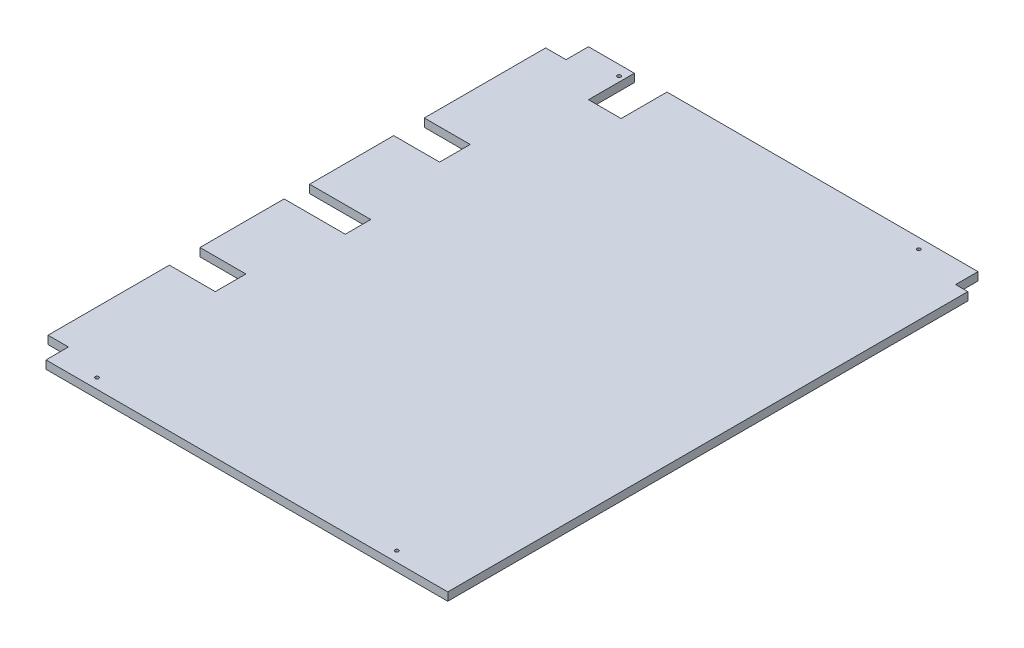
ISO-10303-21;
HEADER;
FILE_DESCRIPTION(('STEP AP214'),'2;1');
FILE_NAME('part.step','',(''),(''),'','','');
FILE_SCHEMA(('AUTOMOTIVE_DESIGN { 1 0 10303 214 1 1 1 1 }'));
ENDSEC;
DATA;
#1=APPLICATION_CONTEXT('core data for automotive mechanical design processes');
#2=APPLICATION_PROTOCOL_DEFINITION('international standard','automotive_design',2000,#1);
#3=PRODUCT_CONTEXT('',#1,'mechanical');
#4=PRODUCT('Part','Part','',(#3));
#5=PRODUCT_RELATED_PRODUCT_CATEGORY('part','',(#4));
#6=PRODUCT_DEFINITION_FORMATION('','',#4);
#7=PRODUCT_DEFINITION_CONTEXT('part definition',#1,'design');
#8=PRODUCT_DEFINITION('design','',#6,#7);
#9=PRODUCT_DEFINITION_SHAPE('','',#8);
#10=(LENGTH_UNIT() NAMED_UNIT(*) SI_UNIT(.MILLI.,.METRE.));
#11=(NAMED_UNIT(*) PLANE_ANGLE_UNIT() SI_UNIT($,.RADIAN.));
#12=(NAMED_UNIT(*) SI_UNIT($,.STERADIAN.) SOLID_ANGLE_UNIT());
#13=UNCERTAINTY_MEASURE_WITH_UNIT(LENGTH_MEASURE(1.E-05),#10,'distance_accuracy_value','');
#14=(GEOMETRIC_REPRESENTATION_CONTEXT(3) GLOBAL_UNCERTAINTY_ASSIGNED_CONTEXT((#13)) GLOBAL_UNIT_ASSIGNED_CONTEXT((#10,
#11,#12)) REPRESENTATION_CONTEXT('',''));
#15=CARTESIAN_POINT('',(0.,0.,0.));
#16=DIRECTION('',(0.,0.,1.));
#17=DIRECTION('',(1.,0.,0.));
#18=AXIS2_PLACEMENT_3D('',#15,#16,#17);
#19=CARTESIAN_POINT('',(-207.,8.,-266.));
#20=DIRECTION('',(0.,0.,1.));
#21=DIRECTION('',(1.,0.,0.));
#22=AXIS2_PLACEMENT_3D('',#19,#20,#21);
#23=PLANE('',#22);
#24=DIRECTION('',(-1.,0.,0.));
#25=VECTOR('',#24,1.);
#26=CARTESIAN_POINT('',(-207.,8.,-266.));
#27=LINE('',#26,#25);
#28=CARTESIAN_POINT('',(-142.,8.,-266.));
#29=VERTEX_POINT('',#28);
#30=CARTESIAN_POINT('',(-187.,8.,-266.));
#31=VERTEX_POINT('',#30);
#32=EDGE_CURVE('E463',#29,#31,#27,.T.);
#33=ORIENTED_EDGE('',*,*,#32,.F.);
#34=DIRECTION('',(0.,1.,0.));
#35=VECTOR('',#34,1.);
#36=CARTESIAN_POINT('',(-142.,0.,-266.));
#37=LINE('',#36,#35);
#38=CARTESIAN_POINT('',(-142.,0.,-266.));
#39=VERTEX_POINT('',#38);
#40=EDGE_CURVE('E304',#39,#29,#37,.T.);
#41=ORIENTED_EDGE('',*,*,#40,.F.);
#42=DIRECTION('',(-1.,0.,0.));
#43=VECTOR('',#42,1.);
#44=CARTESIAN_POINT('',(-207.,0.,-266.));
#45=LINE('',#44,#43);
#46=CARTESIAN_POINT('',(-187.,0.,-266.));
#47=VERTEX_POINT('',#46);
#48=EDGE_CURVE('E252',#39,#47,#45,.T.);
#49=ORIENTED_EDGE('',*,*,#48,.T.);
#50=DIRECTION('',(0.,1.,0.));
#51=VECTOR('',#50,1.);
#52=CARTESIAN_POINT('',(-187.,0.,-266.));
#53=LINE('',#52,#51);
#54=EDGE_CURVE('E398',#47,#31,#53,.T.);
#55=ORIENTED_EDGE('',*,*,#54,.T.);
#56=EDGE_LOOP('',(#33,#41,#49,#55));
#57=FACE_BOUND('',#56,.T.);
#58=ADVANCED_FACE('F40',(#57),#23,.F.);
#59=CARTESIAN_POINT('',(-207.,8.,266.));
#60=DIRECTION('',(1.,0.,0.));
#61=DIRECTION('',(0.,0.,-1.));
#62=AXIS2_PLACEMENT_3D('',#59,#60,#61);
#63=PLANE('',#62);
#64=DIRECTION('',(0.,0.,1.));
#65=VECTOR('',#64,1.);
#66=CARTESIAN_POINT('',(-207.,8.,266.));
#67=LINE('',#66,#65);
#68=CARTESIAN_POINT('',(-207.,8.,12.5));
#69=VERTEX_POINT('',#68);
#70=CARTESIAN_POINT('',(-207.,8.,95.));
#71=VERTEX_POINT('',#70);
#72=EDGE_CURVE('E513',#69,#71,#67,.T.);
#73=ORIENTED_EDGE('',*,*,#72,.F.);
#74=DIRECTION('',(0.,1.,0.));
#75=VECTOR('',#74,1.);
#76=CARTESIAN_POINT('',(-207.,0.,12.5));
#77=LINE('',#76,#75);
#78=CARTESIAN_POINT('',(-207.,0.,12.5));
#79=VERTEX_POINT('',#78);
#80=EDGE_CURVE('E314',#79,#69,#77,.T.);
#81=ORIENTED_EDGE('',*,*,#80,.F.);
#82=DIRECTION('',(0.,0.,1.));
#83=VECTOR('',#82,1.);
#84=CARTESIAN_POINT('',(-207.,0.,266.));
#85=LINE('',#84,#83);
#86=CARTESIAN_POINT('',(-207.,0.,95.));
#87=VERTEX_POINT('',#86);
#88=EDGE_CURVE('E242',#79,#87,#85,.T.);
#89=ORIENTED_EDGE('',*,*,#88,.T.);
#90=DIRECTION('',(0.,1.,0.));
#91=VECTOR('',#90,1.);
#92=CARTESIAN_POINT('',(-207.,0.,95.));
#93=LINE('',#92,#91);
#94=EDGE_CURVE('E369',#87,#71,#93,.T.);
#95=ORIENTED_EDGE('',*,*,#94,.T.);
#96=EDGE_LOOP('',(#73,#81,#89,#95));
#97=FACE_BOUND('',#96,.T.);
#98=ADVANCED_FACE('F581',(#97),#63,.F.);
#99=CARTESIAN_POINT('',(-207.,0.,-95.));
#100=VERTEX_POINT('',#99);
#101=CARTESIAN_POINT('',(-207.,0.,-12.5));
#102=VERTEX_POINT('',#101);
#103=EDGE_CURVE('E250',#100,#102,#85,.T.);
#104=ORIENTED_EDGE('',*,*,#103,.T.);
#105=DIRECTION('',(0.,1.,0.));
#106=VECTOR('',#105,1.);
#107=CARTESIAN_POINT('',(-207.,0.,-12.5));
#108=LINE('',#107,#106);
#109=CARTESIAN_POINT('',(-207.,8.,-12.5));
#110=VERTEX_POINT('',#109);
#111=EDGE_CURVE('E274',#102,#110,#108,.T.);
#112=ORIENTED_EDGE('',*,*,#111,.T.);
#113=CARTESIAN_POINT('',(-207.,8.,-95.));
#114=VERTEX_POINT('',#113);
#115=EDGE_CURVE('E473',#114,#110,#67,.T.);
#116=ORIENTED_EDGE('',*,*,#115,.F.);
#117=DIRECTION('',(0.,1.,0.));
#118=VECTOR('',#117,1.);
#119=CARTESIAN_POINT('',(-207.,0.,-95.));
#120=LINE('',#119,#118);
#121=EDGE_CURVE('E276',#100,#114,#120,.T.);
#122=ORIENTED_EDGE('',*,*,#121,.F.);
#123=EDGE_LOOP('',(#104,#112,#116,#122));
#124=FACE_BOUND('',#123,.T.);
#125=ADVANCED_FACE('F272',(#124),#63,.F.);
#126=CARTESIAN_POINT('',(-207.,0.,-244.));
#127=VERTEX_POINT('',#126);
#128=CARTESIAN_POINT('',(-207.,0.,-125.));
#129=VERTEX_POINT('',#128);
#130=EDGE_CURVE('E245',#127,#129,#85,.T.);
#131=ORIENTED_EDGE('',*,*,#130,.T.);
#132=DIRECTION('',(0.,1.,0.));
#133=VECTOR('',#132,1.);
#134=CARTESIAN_POINT('',(-207.,0.,-125.));
#135=LINE('',#134,#133);
#136=CARTESIAN_POINT('',(-207.,8.,-125.));
#137=VERTEX_POINT('',#136);
#138=EDGE_CURVE('E375',#129,#137,#135,.T.);
#139=ORIENTED_EDGE('',*,*,#138,.T.);
#140=CARTESIAN_POINT('',(-207.,8.,-244.));
#141=VERTEX_POINT('',#140);
#142=EDGE_CURVE('E468',#141,#137,#67,.T.);
#143=ORIENTED_EDGE('',*,*,#142,.F.);
#144=DIRECTION('',(0.,1.,0.));
#145=VECTOR('',#144,1.);
#146=CARTESIAN_POINT('',(-207.,0.,-244.));
#147=LINE('',#146,#145);
#148=EDGE_CURVE('E420',#127,#141,#147,.T.);
#149=ORIENTED_EDGE('',*,*,#148,.F.);
#150=EDGE_LOOP('',(#131,#139,#143,#149));
#151=FACE_BOUND('',#150,.T.);
#152=ADVANCED_FACE('F498',(#151),#63,.F.);
#153=CARTESIAN_POINT('',(207.,8.,266.));
#154=DIRECTION('',(-1.,0.,0.));
#155=DIRECTION('',(0.,0.,1.));
#156=AXIS2_PLACEMENT_3D('',#153,#154,#155);
#157=PLANE('',#156);
#158=DIRECTION('',(0.,0.,-1.));
#159=VECTOR('',#158,1.);
#160=CARTESIAN_POINT('',(207.,0.,266.));
#161=LINE('',#160,#159);
#162=CARTESIAN_POINT('',(207.,0.,266.));
#163=VERTEX_POINT('',#162);
#164=CARTESIAN_POINT('',(207.,0.,-244.));
#165=VERTEX_POINT('',#164);
#166=EDGE_CURVE('E405',#163,#165,#161,.T.);
#167=ORIENTED_EDGE('',*,*,#166,.T.);
#168=DIRECTION('',(0.,1.,0.));
#169=VECTOR('',#168,1.);
#170=CARTESIAN_POINT('',(207.,0.,-244.));
#171=LINE('',#170,#169);
#172=CARTESIAN_POINT('',(207.,8.,-244.));
#173=VERTEX_POINT('',#172);
#174=EDGE_CURVE('E425',#165,#173,#171,.T.);
#175=ORIENTED_EDGE('',*,*,#174,.T.);
#176=DIRECTION('',(0.,0.,-1.));
#177=VECTOR('',#176,1.);
#178=CARTESIAN_POINT('',(207.,8.,266.));
#179=LINE('',#178,#177);
#180=CARTESIAN_POINT('',(207.,8.,266.));
#181=VERTEX_POINT('',#180);
#182=EDGE_CURVE('E265',#181,#173,#179,.T.);
#183=ORIENTED_EDGE('',*,*,#182,.F.);
#184=DIRECTION('',(0.,-1.,0.));
#185=VECTOR('',#184,1.);
#186=CARTESIAN_POINT('',(207.,8.,266.));
#187=LINE('',#186,#185);
#188=EDGE_CURVE('E476',#181,#163,#187,.T.);
#189=ORIENTED_EDGE('',*,*,#188,.T.);
#190=EDGE_LOOP('',(#167,#175,#183,#189));
#191=FACE_BOUND('',#190,.T.);
#192=ADVANCED_FACE('F591',(#191),#157,.F.);
#193=CARTESIAN_POINT('',(195.,0.,-266.));
#194=VERTEX_POINT('',#193);
#195=CARTESIAN_POINT('',(-110.,0.,-266.));
#196=VERTEX_POINT('',#195);
#197=EDGE_CURVE('E243',#194,#196,#45,.T.);
#198=ORIENTED_EDGE('',*,*,#197,.T.);
#199=DIRECTION('',(0.,1.,0.));
#200=VECTOR('',#199,1.);
#201=CARTESIAN_POINT('',(-110.,0.,-266.));
#202=LINE('',#201,#200);
#203=CARTESIAN_POINT('',(-110.,8.,-266.));
#204=VERTEX_POINT('',#203);
#205=EDGE_CURVE('E345',#196,#204,#202,.T.);
#206=ORIENTED_EDGE('',*,*,#205,.T.);
#207=CARTESIAN_POINT('',(195.,8.,-266.));
#208=VERTEX_POINT('',#207);
#209=EDGE_CURVE('E464',#208,#204,#27,.T.);
#210=ORIENTED_EDGE('',*,*,#209,.F.);
#211=DIRECTION('',(0.,1.,0.));
#212=VECTOR('',#211,1.);
#213=CARTESIAN_POINT('',(195.,0.,-266.));
#214=LINE('',#213,#212);
#215=EDGE_CURVE('E446',#194,#208,#214,.T.);
#216=ORIENTED_EDGE('',*,*,#215,.F.);
#217=EDGE_LOOP('',(#198,#206,#210,#216));
#218=FACE_BOUND('',#217,.T.);
#219=ADVANCED_FACE('F583',(#218),#23,.F.);
#220=CARTESIAN_POINT('',(-207.,8.,125.));
#221=VERTEX_POINT('',#220);
#222=CARTESIAN_POINT('',(-207.,8.,244.));
#223=VERTEX_POINT('',#222);
#224=EDGE_CURVE('E232',#221,#223,#67,.T.);
#225=ORIENTED_EDGE('',*,*,#224,.F.);
#226=DIRECTION('',(0.,1.,0.));
#227=VECTOR('',#226,1.);
#228=CARTESIAN_POINT('',(-207.,0.,125.));
#229=LINE('',#228,#227);
#230=CARTESIAN_POINT('',(-207.,0.,125.));
#231=VERTEX_POINT('',#230);
#232=EDGE_CURVE('E218',#231,#221,#229,.T.);
#233=ORIENTED_EDGE('',*,*,#232,.F.);
#234=CARTESIAN_POINT('',(-207.,0.,244.));
#235=VERTEX_POINT('',#234);
#236=EDGE_CURVE('E230',#231,#235,#85,.T.);
#237=ORIENTED_EDGE('',*,*,#236,.T.);
#238=DIRECTION('',(0.,1.,0.));
#239=VECTOR('',#238,1.);
#240=CARTESIAN_POINT('',(-207.,0.,244.));
#241=LINE('',#240,#239);
#242=EDGE_CURVE('E402',#235,#223,#241,.T.);
#243=ORIENTED_EDGE('',*,*,#242,.T.);
#244=EDGE_LOOP('',(#225,#233,#237,#243));
#245=FACE_BOUND('',#244,.T.);
#246=ADVANCED_FACE('F228',(#245),#63,.F.);
#247=CARTESIAN_POINT('',(-207.,8.,266.));
#248=DIRECTION('',(0.,0.,-1.));
#249=DIRECTION('',(-1.,0.,0.));
#250=AXIS2_PLACEMENT_3D('',#247,#248,#249);
#251=PLANE('',#250);
#252=DIRECTION('',(1.,0.,0.));
#253=VECTOR('',#252,1.);
#254=CARTESIAN_POINT('',(-207.,8.,266.));
#255=LINE('',#254,#253);
#256=CARTESIAN_POINT('',(-187.,8.,266.));
#257=VERTEX_POINT('',#256);
#258=EDGE_CURVE('E472',#257,#181,#255,.T.);
#259=ORIENTED_EDGE('',*,*,#258,.F.);
#260=DIRECTION('',(0.,1.,0.));
#261=VECTOR('',#260,1.);
#262=CARTESIAN_POINT('',(-187.,0.,266.));
#263=LINE('',#262,#261);
#264=CARTESIAN_POINT('',(-187.,0.,266.));
#265=VERTEX_POINT('',#264);
#266=EDGE_CURVE('E393',#265,#257,#263,.T.);
#267=ORIENTED_EDGE('',*,*,#266,.F.);
#268=DIRECTION('',(1.,0.,0.));
#269=VECTOR('',#268,1.);
#270=CARTESIAN_POINT('',(-207.,0.,266.));
#271=LINE('',#270,#269);
#272=EDGE_CURVE('E257',#265,#163,#271,.T.);
#273=ORIENTED_EDGE('',*,*,#272,.T.);
#274=ORIENTED_EDGE('',*,*,#188,.F.);
#275=EDGE_LOOP('',(#259,#267,#273,#274));
#276=FACE_BOUND('',#275,.T.);
#277=ADVANCED_FACE('F597',(#276),#251,.F.);
#278=CARTESIAN_POINT('',(0.,8.,0.));
#279=DIRECTION('',(0.,-1.,0.));
#280=DIRECTION('',(0.,0.,-1.));
#281=AXIS2_PLACEMENT_3D('',#278,#279,#280);
#282=PLANE('',#281);
#283=CARTESIAN_POINT('',(-147.,8.,256.));
#284=DIRECTION('',(0.,1.,0.));
#285=DIRECTION('',(0.,0.,1.));
#286=AXIS2_PLACEMENT_3D('',#283,#284,#285);
#287=CIRCLE('',#286,1.75);
#288=CARTESIAN_POINT('',(-147.,8.,257.75));
#289=VERTEX_POINT('',#288);
#290=EDGE_CURVE('E1097',#289,#289,#287,.T.);
#291=ORIENTED_EDGE('',*,*,#290,.F.);
#292=EDGE_LOOP('',(#291));
#293=FACE_BOUND('',#292,.T.);
#294=CARTESIAN_POINT('',(147.,8.,256.));
#295=DIRECTION('',(0.,1.,0.));
#296=DIRECTION('',(0.,0.,1.));
#297=AXIS2_PLACEMENT_3D('',#294,#295,#296);
#298=CIRCLE('',#297,1.74999999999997);
#299=CARTESIAN_POINT('',(147.,8.,257.75));
#300=VERTEX_POINT('',#299);
#301=EDGE_CURVE('E1012',#300,#300,#298,.T.);
#302=ORIENTED_EDGE('',*,*,#301,.F.);
#303=EDGE_LOOP('',(#302));
#304=FACE_BOUND('',#303,.T.);
#305=CARTESIAN_POINT('',(147.,8.,-256.));
#306=DIRECTION('',(0.,1.,0.));
#307=DIRECTION('',(0.,0.,1.));
#308=AXIS2_PLACEMENT_3D('',#305,#306,#307);
#309=CIRCLE('',#308,1.75);
#310=CARTESIAN_POINT('',(147.,8.,-254.25));
#311=VERTEX_POINT('',#310);
#312=EDGE_CURVE('E1007',#311,#311,#309,.T.);
#313=ORIENTED_EDGE('',*,*,#312,.F.);
#314=EDGE_LOOP('',(#313));
#315=FACE_BOUND('',#314,.T.);
#316=CARTESIAN_POINT('',(-147.,8.,-256.));
#317=DIRECTION('',(0.,1.,0.));
#318=DIRECTION('',(0.,0.,1.));
#319=AXIS2_PLACEMENT_3D('',#316,#317,#318);
#320=CIRCLE('',#319,1.75);
#321=CARTESIAN_POINT('',(-147.,8.,-254.25));
#322=VERTEX_POINT('',#321);
#323=EDGE_CURVE('E337',#322,#322,#320,.T.);
#324=ORIENTED_EDGE('',*,*,#323,.F.);
#325=EDGE_LOOP('',(#324));
#326=FACE_BOUND('',#325,.T.);
#327=DIRECTION('',(1.,0.,0.));
#328=VECTOR('',#327,1.);
#329=CARTESIAN_POINT('',(-142.,8.,-221.));
#330=LINE('',#329,#328);
#331=CARTESIAN_POINT('',(-142.,8.,-221.));
#332=VERTEX_POINT('',#331);
#333=CARTESIAN_POINT('',(-110.,8.,-221.));
#334=VERTEX_POINT('',#333);
#335=EDGE_CURVE('E336',#332,#334,#330,.T.);
#336=ORIENTED_EDGE('',*,*,#335,.F.);
#337=DIRECTION('',(0.,0.,1.));
#338=VECTOR('',#337,1.);
#339=CARTESIAN_POINT('',(-142.,8.,-266.));
#340=LINE('',#339,#338);
#341=EDGE_CURVE('E332',#29,#332,#340,.T.);
#342=ORIENTED_EDGE('',*,*,#341,.F.);
#343=ORIENTED_EDGE('',*,*,#32,.T.);
#344=DIRECTION('',(0.,0.,-1.));
#345=VECTOR('',#344,1.);
#346=CARTESIAN_POINT('',(-187.,8.,-266.));
#347=LINE('',#346,#345);
#348=CARTESIAN_POINT('',(-187.,8.,-244.));
#349=VERTEX_POINT('',#348);
#350=EDGE_CURVE('E416',#349,#31,#347,.T.);
#351=ORIENTED_EDGE('',*,*,#350,.F.);
#352=DIRECTION('',(1.,0.,0.));
#353=VECTOR('',#352,1.);
#354=CARTESIAN_POINT('',(-207.,8.,-244.));
#355=LINE('',#354,#353);
#356=EDGE_CURVE('E421',#141,#349,#355,.T.);
#357=ORIENTED_EDGE('',*,*,#356,.F.);
#358=ORIENTED_EDGE('',*,*,#142,.T.);
#359=DIRECTION('',(-1.,0.,0.));
#360=VECTOR('',#359,1.);
#361=CARTESIAN_POINT('',(-207.,8.,-125.));
#362=LINE('',#361,#360);
#363=CARTESIAN_POINT('',(-162.,8.,-125.));
#364=VERTEX_POINT('',#363);
#365=EDGE_CURVE('E357',#364,#137,#362,.T.);
#366=ORIENTED_EDGE('',*,*,#365,.F.);
#367=DIRECTION('',(0.,0.,-1.));
#368=VECTOR('',#367,1.);
#369=CARTESIAN_POINT('',(-162.,8.,-125.));
#370=LINE('',#369,#368);
#371=CARTESIAN_POINT('',(-162.,8.,-95.));
#372=VERTEX_POINT('',#371);
#373=EDGE_CURVE('E368',#372,#364,#370,.T.);
#374=ORIENTED_EDGE('',*,*,#373,.F.);
#375=DIRECTION('',(1.,0.,0.));
#376=VECTOR('',#375,1.);
#377=CARTESIAN_POINT('',(-207.,8.,-95.));
#378=LINE('',#377,#376);
#379=EDGE_CURVE('E364',#114,#372,#378,.T.);
#380=ORIENTED_EDGE('',*,*,#379,.F.);
#381=ORIENTED_EDGE('',*,*,#115,.T.);
#382=DIRECTION('',(-1.,0.,0.));
#383=VECTOR('',#382,1.);
#384=CARTESIAN_POINT('',(-147.,8.,-12.5));
#385=LINE('',#384,#383);
#386=CARTESIAN_POINT('',(-147.,8.,-12.5));
#387=VERTEX_POINT('',#386);
#388=EDGE_CURVE('E303',#387,#110,#385,.T.);
#389=ORIENTED_EDGE('',*,*,#388,.F.);
#390=DIRECTION('',(0.,0.,-1.));
#391=VECTOR('',#390,1.);
#392=CARTESIAN_POINT('',(-147.,8.,-12.5));
#393=LINE('',#392,#391);
#394=CARTESIAN_POINT('',(-147.,8.,12.5));
#395=VERTEX_POINT('',#394);
#396=EDGE_CURVE('E299',#395,#387,#393,.T.);
#397=ORIENTED_EDGE('',*,*,#396,.F.);
#398=DIRECTION('',(1.,0.,0.));
#399=VECTOR('',#398,1.);
#400=CARTESIAN_POINT('',(-147.,8.,12.5));
#401=LINE('',#400,#399);
#402=EDGE_CURVE('E296',#69,#395,#401,.T.);
#403=ORIENTED_EDGE('',*,*,#402,.F.);
#404=ORIENTED_EDGE('',*,*,#72,.T.);
#405=DIRECTION('',(-1.,0.,0.));
#406=VECTOR('',#405,1.);
#407=CARTESIAN_POINT('',(-207.,8.,95.));
#408=LINE('',#407,#406);
#409=CARTESIAN_POINT('',(-162.,8.,95.));
#410=VERTEX_POINT('',#409);
#411=EDGE_CURVE('E224',#410,#71,#408,.T.);
#412=ORIENTED_EDGE('',*,*,#411,.F.);
#413=DIRECTION('',(0.,0.,-1.));
#414=VECTOR('',#413,1.);
#415=CARTESIAN_POINT('',(-162.,8.,95.));
#416=LINE('',#415,#414);
#417=CARTESIAN_POINT('',(-162.,8.,125.));
#418=VERTEX_POINT('',#417);
#419=EDGE_CURVE('E1023',#418,#410,#416,.T.);
#420=ORIENTED_EDGE('',*,*,#419,.F.);
#421=DIRECTION('',(1.,0.,0.));
#422=VECTOR('',#421,1.);
#423=CARTESIAN_POINT('',(-207.,8.,125.));
#424=LINE('',#423,#422);
#425=EDGE_CURVE('E313',#221,#418,#424,.T.);
#426=ORIENTED_EDGE('',*,*,#425,.F.);
#427=ORIENTED_EDGE('',*,*,#224,.T.);
#428=DIRECTION('',(-1.,0.,0.));
#429=VECTOR('',#428,1.);
#430=CARTESIAN_POINT('',(-207.,8.,244.));
#431=LINE('',#430,#429);
#432=CARTESIAN_POINT('',(-187.,8.,244.));
#433=VERTEX_POINT('',#432);
#434=EDGE_CURVE('E390',#433,#223,#431,.T.);
#435=ORIENTED_EDGE('',*,*,#434,.F.);
#436=DIRECTION('',(0.,0.,-1.));
#437=VECTOR('',#436,1.);
#438=CARTESIAN_POINT('',(-187.,8.,266.));
#439=LINE('',#438,#437);
#440=EDGE_CURVE('E394',#257,#433,#439,.T.);
#441=ORIENTED_EDGE('',*,*,#440,.F.);
#442=ORIENTED_EDGE('',*,*,#258,.T.);
#443=ORIENTED_EDGE('',*,*,#182,.T.);
#444=DIRECTION('',(1.,0.,0.));
#445=VECTOR('',#444,1.);
#446=CARTESIAN_POINT('',(207.,8.,-244.));
#447=LINE('',#446,#445);
#448=CARTESIAN_POINT('',(195.,8.,-244.));
#449=VERTEX_POINT('',#448);
#450=EDGE_CURVE('E442',#449,#173,#447,.T.);
#451=ORIENTED_EDGE('',*,*,#450,.F.);
#452=DIRECTION('',(0.,0.,1.));
#453=VECTOR('',#452,1.);
#454=CARTESIAN_POINT('',(195.,8.,-266.));
#455=LINE('',#454,#453);
#456=EDGE_CURVE('E378',#208,#449,#455,.T.);
#457=ORIENTED_EDGE('',*,*,#456,.F.);
#458=ORIENTED_EDGE('',*,*,#209,.T.);
#459=DIRECTION('',(0.,0.,-1.));
#460=VECTOR('',#459,1.);
#461=CARTESIAN_POINT('',(-110.,8.,-266.));
#462=LINE('',#461,#460);
#463=EDGE_CURVE('E325',#334,#204,#462,.T.);
#464=ORIENTED_EDGE('',*,*,#463,.F.);
#465=EDGE_LOOP('',(#336,#342,#343,#351,#357,#358,#366,#374,#380,#381,#389,#397,#403,#404,#412,
#420,#426,#427,#435,#441,#442,#443,#451,#457,#458,#464));
#466=FACE_BOUND('',#465,.T.);
#467=ADVANCED_FACE('F502',(#293,#304,#315,#326,#466),#282,.F.);
#468=CARTESIAN_POINT('',(0.,0.,0.));
#469=DIRECTION('',(0.,-1.,0.));
#470=DIRECTION('',(0.,0.,-1.));
#471=AXIS2_PLACEMENT_3D('',#468,#469,#470);
#472=PLANE('',#471);
#473=CARTESIAN_POINT('',(147.,0.,-256.));
#474=DIRECTION('',(0.,-1.,0.));
#475=DIRECTION('',(0.,0.,-1.));
#476=AXIS2_PLACEMENT_3D('',#473,#474,#475);
#477=CIRCLE('',#476,3.25000000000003);
#478=CARTESIAN_POINT('',(147.,0.,-259.25));
#479=VERTEX_POINT('',#478);
#480=EDGE_CURVE('E538',#479,#479,#477,.F.);
#481=ORIENTED_EDGE('',*,*,#480,.T.);
#482=EDGE_LOOP('',(#481));
#483=FACE_BOUND('',#482,.T.);
#484=CARTESIAN_POINT('',(-147.,0.,-256.));
#485=DIRECTION('',(0.,-1.,0.));
#486=DIRECTION('',(0.,0.,-1.));
#487=AXIS2_PLACEMENT_3D('',#484,#485,#486);
#488=CIRCLE('',#487,3.25000000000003);
#489=CARTESIAN_POINT('',(-147.,0.,-259.25));
#490=VERTEX_POINT('',#489);
#491=EDGE_CURVE('E533',#490,#490,#488,.F.);
#492=ORIENTED_EDGE('',*,*,#491,.T.);
#493=EDGE_LOOP('',(#492));
#494=FACE_BOUND('',#493,.T.);
#495=CARTESIAN_POINT('',(-147.,0.,256.));
#496=DIRECTION('',(0.,-1.,0.));
#497=DIRECTION('',(0.,0.,-1.));
#498=AXIS2_PLACEMENT_3D('',#495,#496,#497);
#499=CIRCLE('',#498,3.25000000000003);
#500=CARTESIAN_POINT('',(-147.,0.,252.75));
#501=VERTEX_POINT('',#500);
#502=EDGE_CURVE('E528',#501,#501,#499,.F.);
#503=ORIENTED_EDGE('',*,*,#502,.T.);
#504=EDGE_LOOP('',(#503));
#505=FACE_BOUND('',#504,.T.);
#506=CARTESIAN_POINT('',(147.,0.,256.));
#507=DIRECTION('',(0.,-1.,0.));
#508=DIRECTION('',(0.,0.,-1.));
#509=AXIS2_PLACEMENT_3D('',#506,#507,#508);
#510=CIRCLE('',#509,3.25000000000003);
#511=CARTESIAN_POINT('',(147.,0.,252.75));
#512=VERTEX_POINT('',#511);
#513=EDGE_CURVE('E523',#512,#512,#510,.F.);
#514=ORIENTED_EDGE('',*,*,#513,.T.);
#515=EDGE_LOOP('',(#514));
#516=FACE_BOUND('',#515,.T.);
#517=DIRECTION('',(0.,0.,1.));
#518=VECTOR('',#517,1.);
#519=CARTESIAN_POINT('',(-142.,0.,-266.));
#520=LINE('',#519,#518);
#521=CARTESIAN_POINT('',(-142.,0.,-221.));
#522=VERTEX_POINT('',#521);
#523=EDGE_CURVE('E321',#39,#522,#520,.T.);
#524=ORIENTED_EDGE('',*,*,#523,.T.);
#525=DIRECTION('',(1.,0.,0.));
#526=VECTOR('',#525,1.);
#527=CARTESIAN_POINT('',(-142.,0.,-221.));
#528=LINE('',#527,#526);
#529=CARTESIAN_POINT('',(-110.,0.,-221.));
#530=VERTEX_POINT('',#529);
#531=EDGE_CURVE('E324',#522,#530,#528,.T.);
#532=ORIENTED_EDGE('',*,*,#531,.T.);
#533=DIRECTION('',(0.,0.,-1.));
#534=VECTOR('',#533,1.);
#535=CARTESIAN_POINT('',(-110.,0.,-266.));
#536=LINE('',#535,#534);
#537=EDGE_CURVE('E57',#530,#196,#536,.T.);
#538=ORIENTED_EDGE('',*,*,#537,.T.);
#539=ORIENTED_EDGE('',*,*,#197,.F.);
#540=DIRECTION('',(0.,0.,1.));
#541=VECTOR('',#540,1.);
#542=CARTESIAN_POINT('',(195.,0.,-266.));
#543=LINE('',#542,#541);
#544=CARTESIAN_POINT('',(195.,0.,-244.));
#545=VERTEX_POINT('',#544);
#546=EDGE_CURVE('E437',#194,#545,#543,.T.);
#547=ORIENTED_EDGE('',*,*,#546,.T.);
#548=DIRECTION('',(1.,0.,0.));
#549=VECTOR('',#548,1.);
#550=CARTESIAN_POINT('',(207.,0.,-244.));
#551=LINE('',#550,#549);
#552=EDGE_CURVE('E441',#545,#165,#551,.T.);
#553=ORIENTED_EDGE('',*,*,#552,.T.);
#554=ORIENTED_EDGE('',*,*,#166,.F.);
#555=ORIENTED_EDGE('',*,*,#272,.F.);
#556=DIRECTION('',(0.,0.,-1.));
#557=VECTOR('',#556,1.);
#558=CARTESIAN_POINT('',(-187.,0.,266.));
#559=LINE('',#558,#557);
#560=CARTESIAN_POINT('',(-187.,0.,244.));
#561=VERTEX_POINT('',#560);
#562=EDGE_CURVE('E387',#265,#561,#559,.T.);
#563=ORIENTED_EDGE('',*,*,#562,.T.);
#564=DIRECTION('',(-1.,0.,0.));
#565=VECTOR('',#564,1.);
#566=CARTESIAN_POINT('',(-207.,0.,244.));
#567=LINE('',#566,#565);
#568=EDGE_CURVE('E240',#561,#235,#567,.T.);
#569=ORIENTED_EDGE('',*,*,#568,.T.);
#570=ORIENTED_EDGE('',*,*,#236,.F.);
#571=DIRECTION('',(1.,0.,0.));
#572=VECTOR('',#571,1.);
#573=CARTESIAN_POINT('',(-207.,0.,125.));
#574=LINE('',#573,#572);
#575=CARTESIAN_POINT('',(-162.,0.,125.));
#576=VERTEX_POINT('',#575);
#577=EDGE_CURVE('E214',#231,#576,#574,.T.);
#578=ORIENTED_EDGE('',*,*,#577,.T.);
#579=DIRECTION('',(0.,0.,-1.));
#580=VECTOR('',#579,1.);
#581=CARTESIAN_POINT('',(-162.,0.,95.));
#582=LINE('',#581,#580);
#583=CARTESIAN_POINT('',(-162.,0.,95.));
#584=VERTEX_POINT('',#583);
#585=EDGE_CURVE('E65',#576,#584,#582,.T.);
#586=ORIENTED_EDGE('',*,*,#585,.T.);
#587=DIRECTION('',(-1.,0.,0.));
#588=VECTOR('',#587,1.);
#589=CARTESIAN_POINT('',(-207.,0.,95.));
#590=LINE('',#589,#588);
#591=EDGE_CURVE('E234',#584,#87,#590,.T.);
#592=ORIENTED_EDGE('',*,*,#591,.T.);
#593=ORIENTED_EDGE('',*,*,#88,.F.);
#594=DIRECTION('',(1.,0.,0.));
#595=VECTOR('',#594,1.);
#596=CARTESIAN_POINT('',(-147.,0.,12.5));
#597=LINE('',#596,#595);
#598=CARTESIAN_POINT('',(-147.,0.,12.5));
#599=VERTEX_POINT('',#598);
#600=EDGE_CURVE('E289',#79,#599,#597,.T.);
#601=ORIENTED_EDGE('',*,*,#600,.T.);
#602=DIRECTION('',(0.,0.,-1.));
#603=VECTOR('',#602,1.);
#604=CARTESIAN_POINT('',(-147.,0.,-12.5));
#605=LINE('',#604,#603);
#606=CARTESIAN_POINT('',(-147.,0.,-12.5));
#607=VERTEX_POINT('',#606);
#608=EDGE_CURVE('E286',#599,#607,#605,.T.);
#609=ORIENTED_EDGE('',*,*,#608,.T.);
#610=DIRECTION('',(-1.,0.,0.));
#611=VECTOR('',#610,1.);
#612=CARTESIAN_POINT('',(-147.,0.,-12.5));
#613=LINE('',#612,#611);
#614=EDGE_CURVE('E283',#607,#102,#613,.T.);
#615=ORIENTED_EDGE('',*,*,#614,.T.);
#616=ORIENTED_EDGE('',*,*,#103,.F.);
#617=DIRECTION('',(1.,0.,0.));
#618=VECTOR('',#617,1.);
#619=CARTESIAN_POINT('',(-207.,0.,-95.));
#620=LINE('',#619,#618);
#621=CARTESIAN_POINT('',(-162.,0.,-95.));
#622=VERTEX_POINT('',#621);
#623=EDGE_CURVE('E280',#100,#622,#620,.T.);
#624=ORIENTED_EDGE('',*,*,#623,.T.);
#625=DIRECTION('',(0.,0.,-1.));
#626=VECTOR('',#625,1.);
#627=CARTESIAN_POINT('',(-162.,0.,-125.));
#628=LINE('',#627,#626);
#629=CARTESIAN_POINT('',(-162.,0.,-125.));
#630=VERTEX_POINT('',#629);
#631=EDGE_CURVE('E356',#622,#630,#628,.T.);
#632=ORIENTED_EDGE('',*,*,#631,.T.);
#633=DIRECTION('',(-1.,0.,0.));
#634=VECTOR('',#633,1.);
#635=CARTESIAN_POINT('',(-207.,0.,-125.));
#636=LINE('',#635,#634);
#637=EDGE_CURVE('E360',#630,#129,#636,.T.);
#638=ORIENTED_EDGE('',*,*,#637,.T.);
#639=ORIENTED_EDGE('',*,*,#130,.F.);
#640=DIRECTION('',(1.,0.,0.));
#641=VECTOR('',#640,1.);
#642=CARTESIAN_POINT('',(-207.,0.,-244.));
#643=LINE('',#642,#641);
#644=CARTESIAN_POINT('',(-187.,0.,-244.));
#645=VERTEX_POINT('',#644);
#646=EDGE_CURVE('E411',#127,#645,#643,.T.);
#647=ORIENTED_EDGE('',*,*,#646,.T.);
#648=DIRECTION('',(0.,0.,-1.));
#649=VECTOR('',#648,1.);
#650=CARTESIAN_POINT('',(-187.,0.,-266.));
#651=LINE('',#650,#649);
#652=EDGE_CURVE('E415',#645,#47,#651,.T.);
#653=ORIENTED_EDGE('',*,*,#652,.T.);
#654=ORIENTED_EDGE('',*,*,#48,.F.);
#655=EDGE_LOOP('',(#524,#532,#538,#539,#547,#553,#554,#555,#563,#569,#570,#578,#586,#592,#593,
#601,#609,#615,#616,#624,#632,#638,#639,#647,#653,#654));
#656=FACE_BOUND('',#655,.T.);
#657=ADVANCED_FACE('F238',(#483,#494,#505,#516,#656),#472,.T.);
#658=CARTESIAN_POINT('',(207.,0.,-244.));
#659=DIRECTION('',(0.,0.,1.));
#660=DIRECTION('',(1.,0.,0.));
#661=AXIS2_PLACEMENT_3D('',#658,#659,#660);
#662=PLANE('',#661);
#663=ORIENTED_EDGE('',*,*,#450,.T.);
#664=ORIENTED_EDGE('',*,*,#174,.F.);
#665=ORIENTED_EDGE('',*,*,#552,.F.);
#666=DIRECTION('',(0.,1.,0.));
#667=VECTOR('',#666,1.);
#668=CARTESIAN_POINT('',(195.,0.,-244.));
#669=LINE('',#668,#667);
#670=EDGE_CURVE('E455',#545,#449,#669,.T.);
#671=ORIENTED_EDGE('',*,*,#670,.T.);
#672=EDGE_LOOP('',(#663,#664,#665,#671));
#673=FACE_BOUND('',#672,.T.);
#674=ADVANCED_FACE('F570',(#673),#662,.F.);
#675=CARTESIAN_POINT('',(195.,0.,-266.));
#676=DIRECTION('',(-1.,0.,0.));
#677=DIRECTION('',(0.,0.,1.));
#678=AXIS2_PLACEMENT_3D('',#675,#676,#677);
#679=PLANE('',#678);
#680=ORIENTED_EDGE('',*,*,#456,.T.);
#681=ORIENTED_EDGE('',*,*,#670,.F.);
#682=ORIENTED_EDGE('',*,*,#546,.F.);
#683=ORIENTED_EDGE('',*,*,#215,.T.);
#684=EDGE_LOOP('',(#680,#681,#682,#683));
#685=FACE_BOUND('',#684,.T.);
#686=ADVANCED_FACE('F610',(#685),#679,.F.);
#687=CARTESIAN_POINT('',(-187.,0.,-266.));
#688=DIRECTION('',(1.,0.,0.));
#689=DIRECTION('',(0.,0.,-1.));
#690=AXIS2_PLACEMENT_3D('',#687,#688,#689);
#691=PLANE('',#690);
#692=ORIENTED_EDGE('',*,*,#350,.T.);
#693=ORIENTED_EDGE('',*,*,#54,.F.);
#694=ORIENTED_EDGE('',*,*,#652,.F.);
#695=DIRECTION('',(0.,1.,0.));
#696=VECTOR('',#695,1.);
#697=CARTESIAN_POINT('',(-187.,0.,-244.));
#698=LINE('',#697,#696);
#699=EDGE_CURVE('E432',#645,#349,#698,.T.);
#700=ORIENTED_EDGE('',*,*,#699,.T.);
#701=EDGE_LOOP('',(#692,#693,#694,#700));
#702=FACE_BOUND('',#701,.T.);
#703=ADVANCED_FACE('F491',(#702),#691,.F.);
#704=CARTESIAN_POINT('',(-207.,0.,-244.));
#705=DIRECTION('',(0.,0.,1.));
#706=DIRECTION('',(1.,0.,0.));
#707=AXIS2_PLACEMENT_3D('',#704,#705,#706);
#708=PLANE('',#707);
#709=ORIENTED_EDGE('',*,*,#356,.T.);
#710=ORIENTED_EDGE('',*,*,#699,.F.);
#711=ORIENTED_EDGE('',*,*,#646,.F.);
#712=ORIENTED_EDGE('',*,*,#148,.T.);
#713=EDGE_LOOP('',(#709,#710,#711,#712));
#714=FACE_BOUND('',#713,.T.);
#715=ADVANCED_FACE('F495',(#714),#708,.F.);
#716=CARTESIAN_POINT('',(-207.,0.,244.));
#717=DIRECTION('',(0.,0.,-1.));
#718=DIRECTION('',(-1.,0.,0.));
#719=AXIS2_PLACEMENT_3D('',#716,#717,#718);
#720=PLANE('',#719);
#721=ORIENTED_EDGE('',*,*,#434,.T.);
#722=ORIENTED_EDGE('',*,*,#242,.F.);
#723=ORIENTED_EDGE('',*,*,#568,.F.);
#724=DIRECTION('',(0.,1.,0.));
#725=VECTOR('',#724,1.);
#726=CARTESIAN_POINT('',(-187.,0.,244.));
#727=LINE('',#726,#725);
#728=EDGE_CURVE('E406',#561,#433,#727,.T.);
#729=ORIENTED_EDGE('',*,*,#728,.T.);
#730=EDGE_LOOP('',(#721,#722,#723,#729));
#731=FACE_BOUND('',#730,.T.);
#732=ADVANCED_FACE('F624',(#731),#720,.F.);
#733=CARTESIAN_POINT('',(-187.,0.,266.));
#734=DIRECTION('',(1.,0.,0.));
#735=DIRECTION('',(0.,0.,-1.));
#736=AXIS2_PLACEMENT_3D('',#733,#734,#735);
#737=PLANE('',#736);
#738=ORIENTED_EDGE('',*,*,#440,.T.);
#739=ORIENTED_EDGE('',*,*,#728,.F.);
#740=ORIENTED_EDGE('',*,*,#562,.F.);
#741=ORIENTED_EDGE('',*,*,#266,.T.);
#742=EDGE_LOOP('',(#738,#739,#740,#741));
#743=FACE_BOUND('',#742,.T.);
#744=ADVANCED_FACE('F622',(#743),#737,.F.);
#745=CARTESIAN_POINT('',(-207.,0.,-125.));
#746=DIRECTION('',(0.,0.,-1.));
#747=DIRECTION('',(-1.,0.,0.));
#748=AXIS2_PLACEMENT_3D('',#745,#746,#747);
#749=PLANE('',#748);
#750=ORIENTED_EDGE('',*,*,#365,.T.);
#751=ORIENTED_EDGE('',*,*,#138,.F.);
#752=ORIENTED_EDGE('',*,*,#637,.F.);
#753=DIRECTION('',(0.,1.,0.));
#754=VECTOR('',#753,1.);
#755=CARTESIAN_POINT('',(-162.,0.,-125.));
#756=LINE('',#755,#754);
#757=EDGE_CURVE('E379',#630,#364,#756,.T.);
#758=ORIENTED_EDGE('',*,*,#757,.T.);
#759=EDGE_LOOP('',(#750,#751,#752,#758));
#760=FACE_BOUND('',#759,.T.);
#761=ADVANCED_FACE('F631',(#760),#749,.F.);
#762=CARTESIAN_POINT('',(-162.,0.,-125.));
#763=DIRECTION('',(1.,0.,0.));
#764=DIRECTION('',(0.,0.,-1.));
#765=AXIS2_PLACEMENT_3D('',#762,#763,#764);
#766=PLANE('',#765);
#767=ORIENTED_EDGE('',*,*,#373,.T.);
#768=ORIENTED_EDGE('',*,*,#757,.F.);
#769=ORIENTED_EDGE('',*,*,#631,.F.);
#770=DIRECTION('',(0.,1.,0.));
#771=VECTOR('',#770,1.);
#772=CARTESIAN_POINT('',(-162.,0.,-95.));
#773=LINE('',#772,#771);
#774=EDGE_CURVE('E382',#622,#372,#773,.T.);
#775=ORIENTED_EDGE('',*,*,#774,.T.);
#776=EDGE_LOOP('',(#767,#768,#769,#775));
#777=FACE_BOUND('',#776,.T.);
#778=ADVANCED_FACE('F696',(#777),#766,.F.);
#779=CARTESIAN_POINT('',(-207.,0.,-95.));
#780=DIRECTION('',(0.,0.,1.));
#781=DIRECTION('',(1.,0.,0.));
#782=AXIS2_PLACEMENT_3D('',#779,#780,#781);
#783=PLANE('',#782);
#784=ORIENTED_EDGE('',*,*,#379,.T.);
#785=ORIENTED_EDGE('',*,*,#774,.F.);
#786=ORIENTED_EDGE('',*,*,#623,.F.);
#787=ORIENTED_EDGE('',*,*,#121,.T.);
#788=EDGE_LOOP('',(#784,#785,#786,#787));
#789=FACE_BOUND('',#788,.T.);
#790=ADVANCED_FACE('F635',(#789),#783,.F.);
#791=CARTESIAN_POINT('',(-207.,0.,95.));
#792=DIRECTION('',(0.,0.,-1.));
#793=DIRECTION('',(-1.,0.,0.));
#794=AXIS2_PLACEMENT_3D('',#791,#792,#793);
#795=PLANE('',#794);
#796=ORIENTED_EDGE('',*,*,#411,.T.);
#797=ORIENTED_EDGE('',*,*,#94,.F.);
#798=ORIENTED_EDGE('',*,*,#591,.F.);
#799=DIRECTION('',(0.,1.,0.));
#800=VECTOR('',#799,1.);
#801=CARTESIAN_POINT('',(-162.,0.,95.));
#802=LINE('',#801,#800);
#803=EDGE_CURVE('E1032',#584,#410,#802,.T.);
#804=ORIENTED_EDGE('',*,*,#803,.T.);
#805=EDGE_LOOP('',(#796,#797,#798,#804));
#806=FACE_BOUND('',#805,.T.);
#807=ADVANCED_FACE('F715',(#806),#795,.F.);
#808=CARTESIAN_POINT('',(-162.,0.,95.));
#809=DIRECTION('',(1.,0.,0.));
#810=DIRECTION('',(0.,0.,-1.));
#811=AXIS2_PLACEMENT_3D('',#808,#809,#810);
#812=PLANE('',#811);
#813=ORIENTED_EDGE('',*,*,#419,.T.);
#814=ORIENTED_EDGE('',*,*,#803,.F.);
#815=ORIENTED_EDGE('',*,*,#585,.F.);
#816=DIRECTION('',(0.,1.,0.));
#817=VECTOR('',#816,1.);
#818=CARTESIAN_POINT('',(-162.,0.,125.));
#819=LINE('',#818,#817);
#820=EDGE_CURVE('E220',#576,#418,#819,.T.);
#821=ORIENTED_EDGE('',*,*,#820,.T.);
#822=EDGE_LOOP('',(#813,#814,#815,#821));
#823=FACE_BOUND('',#822,.T.);
#824=ADVANCED_FACE('F724',(#823),#812,.F.);
#825=CARTESIAN_POINT('',(-207.,0.,125.));
#826=DIRECTION('',(0.,0.,1.));
#827=DIRECTION('',(1.,0.,0.));
#828=AXIS2_PLACEMENT_3D('',#825,#826,#827);
#829=PLANE('',#828);
#830=ORIENTED_EDGE('',*,*,#425,.T.);
#831=ORIENTED_EDGE('',*,*,#820,.F.);
#832=ORIENTED_EDGE('',*,*,#577,.F.);
#833=ORIENTED_EDGE('',*,*,#232,.T.);
#834=EDGE_LOOP('',(#830,#831,#832,#833));
#835=FACE_BOUND('',#834,.T.);
#836=ADVANCED_FACE('F217',(#835),#829,.F.);
#837=CARTESIAN_POINT('',(-147.,0.,-12.5));
#838=DIRECTION('',(1.,0.,0.));
#839=DIRECTION('',(0.,0.,-1.));
#840=AXIS2_PLACEMENT_3D('',#837,#838,#839);
#841=PLANE('',#840);
#842=ORIENTED_EDGE('',*,*,#396,.T.);
#843=DIRECTION('',(0.,1.,0.));
#844=VECTOR('',#843,1.);
#845=CARTESIAN_POINT('',(-147.,0.,-12.5));
#846=LINE('',#845,#844);
#847=EDGE_CURVE('E294',#607,#387,#846,.T.);
#848=ORIENTED_EDGE('',*,*,#847,.F.);
#849=ORIENTED_EDGE('',*,*,#608,.F.);
#850=DIRECTION('',(0.,1.,0.));
#851=VECTOR('',#850,1.);
#852=CARTESIAN_POINT('',(-147.,0.,12.5));
#853=LINE('',#852,#851);
#854=EDGE_CURVE('E310',#599,#395,#853,.T.);
#855=ORIENTED_EDGE('',*,*,#854,.T.);
#856=EDGE_LOOP('',(#842,#848,#849,#855));
#857=FACE_BOUND('',#856,.T.);
#858=ADVANCED_FACE('F742',(#857),#841,.F.);
#859=CARTESIAN_POINT('',(-147.,0.,12.5));
#860=DIRECTION('',(0.,0.,1.));
#861=DIRECTION('',(1.,0.,0.));
#862=AXIS2_PLACEMENT_3D('',#859,#860,#861);
#863=PLANE('',#862);
#864=ORIENTED_EDGE('',*,*,#402,.T.);
#865=ORIENTED_EDGE('',*,*,#854,.F.);
#866=ORIENTED_EDGE('',*,*,#600,.F.);
#867=ORIENTED_EDGE('',*,*,#80,.T.);
#868=EDGE_LOOP('',(#864,#865,#866,#867));
#869=FACE_BOUND('',#868,.T.);
#870=ADVANCED_FACE('F751',(#869),#863,.F.);
#871=CARTESIAN_POINT('',(-147.,0.,-12.5));
#872=DIRECTION('',(0.,0.,-1.));
#873=DIRECTION('',(-1.,0.,0.));
#874=AXIS2_PLACEMENT_3D('',#871,#872,#873);
#875=PLANE('',#874);
#876=ORIENTED_EDGE('',*,*,#388,.T.);
#877=ORIENTED_EDGE('',*,*,#111,.F.);
#878=ORIENTED_EDGE('',*,*,#614,.F.);
#879=ORIENTED_EDGE('',*,*,#847,.T.);
#880=EDGE_LOOP('',(#876,#877,#878,#879));
#881=FACE_BOUND('',#880,.T.);
#882=ADVANCED_FACE('F761',(#881),#875,.F.);
#883=CARTESIAN_POINT('',(-142.,0.,-266.));
#884=DIRECTION('',(-1.,0.,0.));
#885=DIRECTION('',(0.,0.,1.));
#886=AXIS2_PLACEMENT_3D('',#883,#884,#885);
#887=PLANE('',#886);
#888=ORIENTED_EDGE('',*,*,#341,.T.);
#889=DIRECTION('',(0.,1.,0.));
#890=VECTOR('',#889,1.);
#891=CARTESIAN_POINT('',(-142.,0.,-221.));
#892=LINE('',#891,#890);
#893=EDGE_CURVE('E331',#522,#332,#892,.T.);
#894=ORIENTED_EDGE('',*,*,#893,.F.);
#895=ORIENTED_EDGE('',*,*,#523,.F.);
#896=ORIENTED_EDGE('',*,*,#40,.T.);
#897=EDGE_LOOP('',(#888,#894,#895,#896));
#898=FACE_BOUND('',#897,.T.);
#899=ADVANCED_FACE('F771',(#898),#887,.F.);
#900=CARTESIAN_POINT('',(-110.,0.,-266.));
#901=DIRECTION('',(1.,0.,0.));
#902=DIRECTION('',(0.,0.,-1.));
#903=AXIS2_PLACEMENT_3D('',#900,#901,#902);
#904=PLANE('',#903);
#905=ORIENTED_EDGE('',*,*,#463,.T.);
#906=ORIENTED_EDGE('',*,*,#205,.F.);
#907=ORIENTED_EDGE('',*,*,#537,.F.);
#908=DIRECTION('',(0.,1.,0.));
#909=VECTOR('',#908,1.);
#910=CARTESIAN_POINT('',(-110.,0.,-221.));
#911=LINE('',#910,#909);
#912=EDGE_CURVE('E349',#530,#334,#911,.T.);
#913=ORIENTED_EDGE('',*,*,#912,.T.);
#914=EDGE_LOOP('',(#905,#906,#907,#913));
#915=FACE_BOUND('',#914,.T.);
#916=ADVANCED_FACE('F605',(#915),#904,.F.);
#917=CARTESIAN_POINT('',(-142.,0.,-221.));
#918=DIRECTION('',(0.,0.,1.));
#919=DIRECTION('',(1.,0.,0.));
#920=AXIS2_PLACEMENT_3D('',#917,#918,#919);
#921=PLANE('',#920);
#922=ORIENTED_EDGE('',*,*,#335,.T.);
#923=ORIENTED_EDGE('',*,*,#912,.F.);
#924=ORIENTED_EDGE('',*,*,#531,.F.);
#925=ORIENTED_EDGE('',*,*,#893,.T.);
#926=EDGE_LOOP('',(#922,#923,#924,#925));
#927=FACE_BOUND('',#926,.T.);
#928=ADVANCED_FACE('F603',(#927),#921,.F.);
#929=CARTESIAN_POINT('',(-147.,8.,-256.));
#930=DIRECTION('',(0.,1.,0.));
#931=DIRECTION('',(0.,0.,1.));
#932=AXIS2_PLACEMENT_3D('',#929,#930,#931);
#933=CYLINDRICAL_SURFACE('',#932,1.75);
#934=CARTESIAN_POINT('',(-147.,1.50000000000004,-256.));
#935=DIRECTION('',(0.,-1.,0.));
#936=DIRECTION('',(0.,0.,-1.));
#937=AXIS2_PLACEMENT_3D('',#934,#935,#936);
#938=CIRCLE('',#937,1.75);
#939=CARTESIAN_POINT('',(-147.,1.50000000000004,-257.75));
#940=VERTEX_POINT('',#939);
#941=EDGE_CURVE('E548',#940,#940,#938,.T.);
#942=ORIENTED_EDGE('',*,*,#941,.T.);
#943=EDGE_LOOP('',(#942));
#944=FACE_BOUND('',#943,.T.);
#945=ORIENTED_EDGE('',*,*,#323,.T.);
#946=EDGE_LOOP('',(#945));
#947=FACE_BOUND('',#946,.T.);
#948=ADVANCED_FACE('F797',(#944,#947),#933,.F.);
#949=CARTESIAN_POINT('',(147.,8.,-256.));
#950=DIRECTION('',(0.,1.,0.));
#951=DIRECTION('',(0.,0.,1.));
#952=AXIS2_PLACEMENT_3D('',#949,#950,#951);
#953=CYLINDRICAL_SURFACE('',#952,1.75);
#954=CARTESIAN_POINT('',(147.,1.50000000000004,-256.));
#955=DIRECTION('',(0.,-1.,0.));
#956=DIRECTION('',(0.,0.,-1.));
#957=AXIS2_PLACEMENT_3D('',#954,#955,#956);
#958=CIRCLE('',#957,1.75);
#959=CARTESIAN_POINT('',(147.,1.50000000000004,-257.75));
#960=VERTEX_POINT('',#959);
#961=EDGE_CURVE('E543',#960,#960,#958,.T.);
#962=ORIENTED_EDGE('',*,*,#961,.T.);
#963=EDGE_LOOP('',(#962));
#964=FACE_BOUND('',#963,.T.);
#965=ORIENTED_EDGE('',*,*,#312,.T.);
#966=EDGE_LOOP('',(#965));
#967=FACE_BOUND('',#966,.T.);
#968=ADVANCED_FACE('F806',(#964,#967),#953,.F.);
#969=CARTESIAN_POINT('',(147.,8.,256.));
#970=DIRECTION('',(0.,1.,0.));
#971=DIRECTION('',(0.,0.,1.));
#972=AXIS2_PLACEMENT_3D('',#969,#970,#971);
#973=CYLINDRICAL_SURFACE('',#972,1.74999999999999);
#974=CARTESIAN_POINT('',(147.,1.50000000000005,256.));
#975=DIRECTION('',(0.,-1.,0.));
#976=DIRECTION('',(0.,0.,-1.));
#977=AXIS2_PLACEMENT_3D('',#974,#975,#976);
#978=CIRCLE('',#977,1.74999999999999);
#979=CARTESIAN_POINT('',(147.,1.50000000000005,254.25));
#980=VERTEX_POINT('',#979);
#981=EDGE_CURVE('E11',#980,#980,#978,.T.);
#982=ORIENTED_EDGE('',*,*,#981,.T.);
#983=EDGE_LOOP('',(#982));
#984=FACE_BOUND('',#983,.T.);
#985=ORIENTED_EDGE('',*,*,#301,.T.);
#986=EDGE_LOOP('',(#985));
#987=FACE_BOUND('',#986,.T.);
#988=ADVANCED_FACE('F816',(#984,#987),#973,.F.);
#989=CARTESIAN_POINT('',(-147.,8.,256.));
#990=DIRECTION('',(0.,1.,0.));
#991=DIRECTION('',(0.,0.,1.));
#992=AXIS2_PLACEMENT_3D('',#989,#990,#991);
#993=CYLINDRICAL_SURFACE('',#992,1.75);
#994=CARTESIAN_POINT('',(-147.,1.50000000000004,256.));
#995=DIRECTION('',(0.,-1.,0.));
#996=DIRECTION('',(0.,0.,-1.));
#997=AXIS2_PLACEMENT_3D('',#994,#995,#996);
#998=CIRCLE('',#997,1.75);
#999=CARTESIAN_POINT('',(-147.,1.50000000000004,254.25));
#1000=VERTEX_POINT('',#999);
#1001=EDGE_CURVE('E50',#1000,#1000,#998,.T.);
#1002=ORIENTED_EDGE('',*,*,#1001,.T.);
#1003=EDGE_LOOP('',(#1002));
#1004=FACE_BOUND('',#1003,.T.);
#1005=ORIENTED_EDGE('',*,*,#290,.T.);
#1006=EDGE_LOOP('',(#1005));
#1007=FACE_BOUND('',#1006,.T.);
#1008=ADVANCED_FACE('F559',(#1004,#1007),#993,.F.);
#1009=CARTESIAN_POINT('',(147.,0.,-256.));
#1010=DIRECTION('',(0.,-1.,0.));
#1011=DIRECTION('',(0.,0.,-1.));
#1012=AXIS2_PLACEMENT_3D('',#1009,#1010,#1011);
#1013=CONICAL_SURFACE('',#1012,3.25000000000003,0.785398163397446);
#1014=ORIENTED_EDGE('',*,*,#961,.F.);
#1015=EDGE_LOOP('',(#1014));
#1016=FACE_BOUND('',#1015,.T.);
#1017=ORIENTED_EDGE('',*,*,#480,.F.);
#1018=EDGE_LOOP('',(#1017));
#1019=FACE_BOUND('',#1018,.T.);
#1020=ADVANCED_FACE('F835',(#1016,#1019),#1013,.F.);
#1021=CARTESIAN_POINT('',(-147.,0.,-256.));
#1022=DIRECTION('',(0.,-1.,0.));
#1023=DIRECTION('',(0.,0.,-1.));
#1024=AXIS2_PLACEMENT_3D('',#1021,#1022,#1023);
#1025=CONICAL_SURFACE('',#1024,3.25000000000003,0.785398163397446);
#1026=ORIENTED_EDGE('',*,*,#941,.F.);
#1027=EDGE_LOOP('',(#1026));
#1028=FACE_BOUND('',#1027,.T.);
#1029=ORIENTED_EDGE('',*,*,#491,.F.);
#1030=EDGE_LOOP('',(#1029));
#1031=FACE_BOUND('',#1030,.T.);
#1032=ADVANCED_FACE('F565',(#1028,#1031),#1025,.F.);
#1033=CARTESIAN_POINT('',(-147.,0.,256.));
#1034=DIRECTION('',(0.,-1.,0.));
#1035=DIRECTION('',(0.,0.,-1.));
#1036=AXIS2_PLACEMENT_3D('',#1033,#1034,#1035);
#1037=CONICAL_SURFACE('',#1036,3.25000000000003,0.785398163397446);
#1038=ORIENTED_EDGE('',*,*,#1001,.F.);
#1039=EDGE_LOOP('',(#1038));
#1040=FACE_BOUND('',#1039,.T.);
#1041=ORIENTED_EDGE('',*,*,#502,.F.);
#1042=EDGE_LOOP('',(#1041));
#1043=FACE_BOUND('',#1042,.T.);
#1044=ADVANCED_FACE('F562',(#1040,#1043),#1037,.F.);
#1045=CARTESIAN_POINT('',(147.,0.,256.));
#1046=DIRECTION('',(0.,-1.,0.));
#1047=DIRECTION('',(0.,0.,-1.));
#1048=AXIS2_PLACEMENT_3D('',#1045,#1046,#1047);
#1049=CONICAL_SURFACE('',#1048,3.25000000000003,0.785398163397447);
#1050=ORIENTED_EDGE('',*,*,#981,.F.);
#1051=EDGE_LOOP('',(#1050));
#1052=FACE_BOUND('',#1051,.T.);
#1053=ORIENTED_EDGE('',*,*,#513,.F.);
#1054=EDGE_LOOP('',(#1053));
#1055=FACE_BOUND('',#1054,.T.);
#1056=ADVANCED_FACE('F43',(#1052,#1055),#1049,.F.);
#1057=CLOSED_SHELL('',(#58,#98,#125,#152,#192,#219,#246,#277,#467,#657,#674,#686,#703,#715,#732,
#744,#761,#778,#790,#807,#824,#836,#858,#870,#882,#899,#916,#928,#948,#968,#988,#1008,#1020,
#1032,#1044,#1056));
#1058=MANIFOLD_SOLID_BREP('B2',#1057);
#1059=ADVANCED_BREP_SHAPE_REPRESENTATION('',(#18,#1058),#14);
#1060=SHAPE_DEFINITION_REPRESENTATION(#9,#1059);
ENDSEC;
END-ISO-10303-21;
